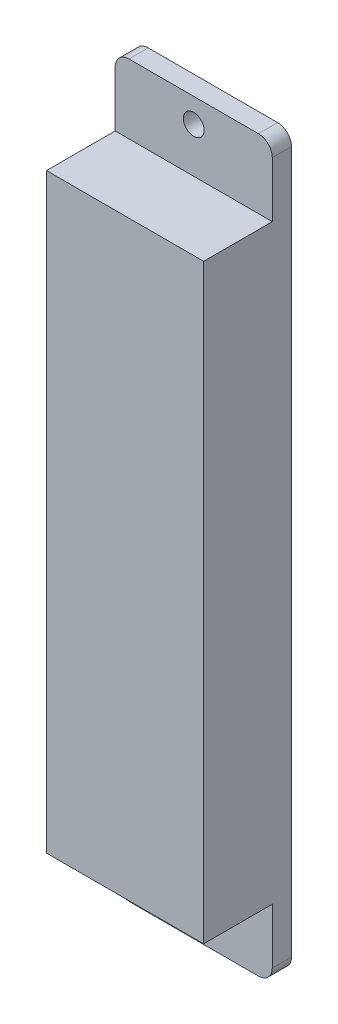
from build123d import *

# Parameters (mm, degrees)
BOSS_EXTRUDE1_DEPTH = 10.2
SKETCH2_W           = 22.7
SKETCH2_H           = 85.4
BOSS_EXTRUDE2_DEPTH = 2.5
SKETCH3_W           = 22.7
SKETCH3_H           = 2.778639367
BOSS_EXTRUDE3_DEPTH = 10
SKETCH4_R           = 1.5
CUT_EXTRUDE1_DEPTH  = 135.456734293
FILLET1_R           = 2


with BuildPart() as part:
    # Sketch1 → Boss-Extrude1 (new body)
    with BuildSketch(Plane.XY):
        Polygon((115.8, -40.2), (115.8, 40.2), (100.6, 40.2), (100.6, 42.7), (123.3, 42.7), (123.3, -42.7), (100.6, -42.7), (100.6, -40.2), align=None)
    extrude(amount=BOSS_EXTRUDE1_DEPTH)

    # Sketch2 → Boss-Extrude2 (add)
    with BuildSketch(Plane.XY.offset(10.2)):
        with Locations((111.95, 0)):
            Rectangle(SKETCH2_W, SKETCH2_H)
    extrude(amount=BOSS_EXTRUDE2_DEPTH)

    # Sketch3 → Boss-Extrude3 (add)
    with BuildSketch(Plane.XZ.offset(42.7)):
        with Locations((111.95, 1.389319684)):
            Rectangle(SKETCH3_W, SKETCH3_H)
    boss_extrude3 = extrude(amount=BOSS_EXTRUDE3_DEPTH)

    # Mirror1: Boss-Extrude3 across plane
    add(boss_extrude3.mirror(Plane(origin=(0, 0, 0), x_dir=(0, 0, 1), z_dir=(0, -1, 0))))

    # Sketch4 → Cut-Extrude1 (cut, through all)
    with BuildSketch(Plane.XY.offset(2.778639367)):
        with Locations((111.95, 49.2)):
            Circle(SKETCH4_R)
    cut_extrude1 = extrude(amount=-CUT_EXTRUDE1_DEPTH, mode=Mode.SUBTRACT)

    # Fillet1
    fillet1_edges = [part.edges().sort_by_distance(p)[0] for p in [
        (123.3, -52.7, 1.389319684),
        (100.6, -52.7, 1.389319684),
        (123.3, 52.7, 1.389319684),
        (100.6, 52.7, 1.389319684),
    ]]
    fillet(fillet1_edges, radius=FILLET1_R)

    # Mirror2: Cut-Extrude1 across plane
    add(cut_extrude1.mirror(Plane(origin=(0, 0, 0), x_dir=(0, 0, 1), z_dir=(0, -1, 0))), mode=Mode.SUBTRACT)


solid = part.part
